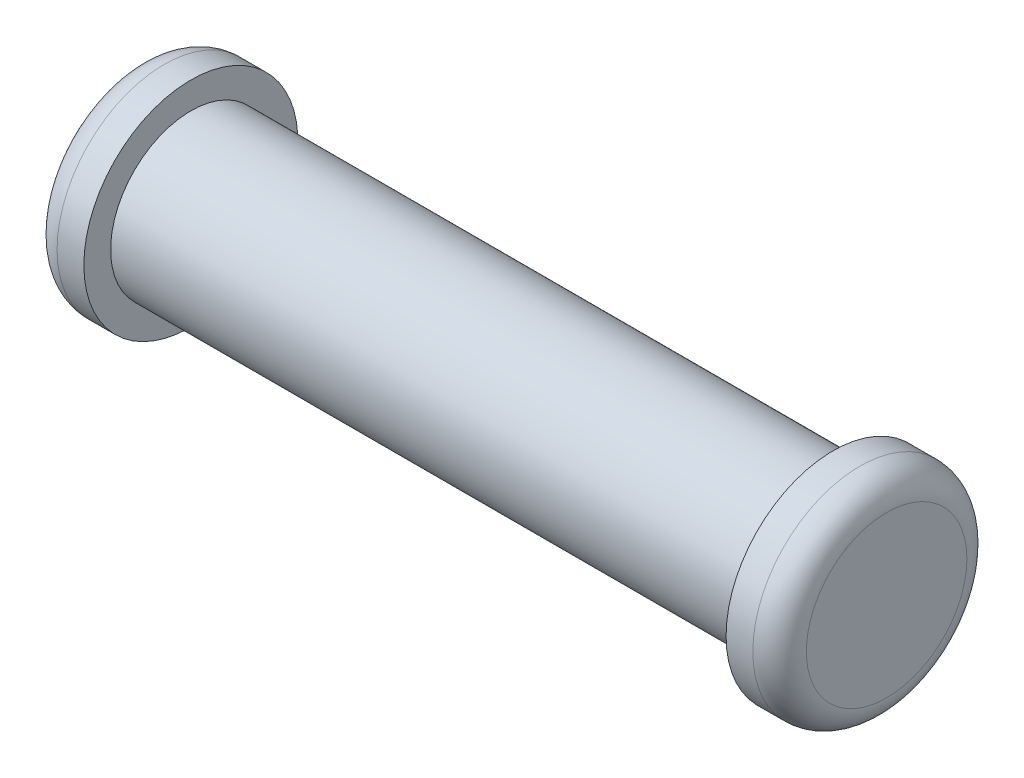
from build123d import *

# Parameters (mm, degrees)
SKETCH1_R            = 1.5
BOSS_EXTRUDE1_DEPTH  = 12
SKETCH2_R            = 2
BOSS_EXTRUDE2_DEPTH  = 1
FILLET2_R            = 0.5
FILLET2_OF_MIRROR1_R = 0.5


with BuildPart() as part:
    # Sketch1 → Boss-Extrude1 (new body)
    with BuildSketch(Plane(origin=(0, 0, 0), x_dir=(0, 0, -1), z_dir=(1, 0, 0))):
        Circle(SKETCH1_R)
    extrude(amount=BOSS_EXTRUDE1_DEPTH)

    # Sketch2 → Boss-Extrude2 (add)
    with BuildSketch(Plane.ZY):
        Circle(SKETCH2_R)
    boss_extrude2 = extrude(amount=BOSS_EXTRUDE2_DEPTH)

    # Fillet2
    fillet2_edges = [part.edges().sort_by_distance(p)[0] for p in [
        (-1, 0, -2),
    ]]
    fillet(fillet2_edges, radius=FILLET2_R)

    # Mirror1: Boss-Extrude2 across plane
    add(boss_extrude2.mirror(Plane(origin=(6, 0, 0), x_dir=(0, 0, 1), z_dir=(1, 0, 0))))

    # Fillet2 of Mirror1
    fillet2_of_mirror1_edges = [part.edges().sort_by_distance(p)[0] for p in [
        (13, 0, -2),
    ]]
    fillet(fillet2_of_mirror1_edges, radius=FILLET2_OF_MIRROR1_R)


solid = part.part
